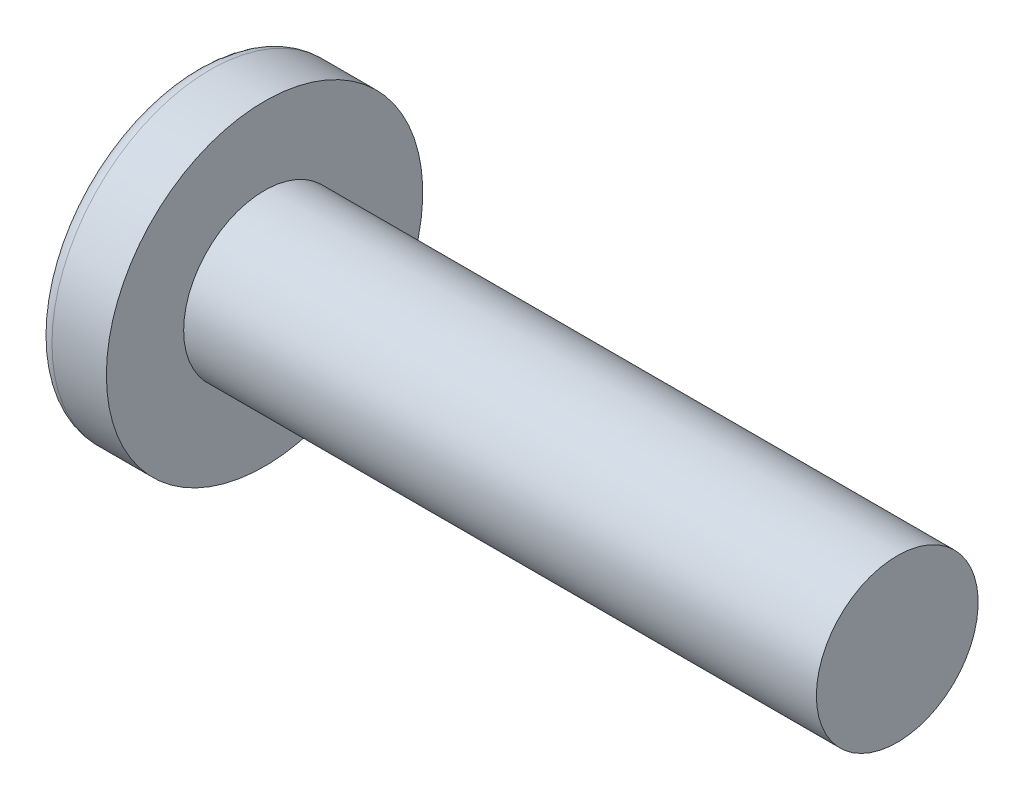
from build123d import *

# Parameters (mm, degrees)
CIRPATTERN1_COUNT = 2
CIRPATTERN1_ANGLE = 90


with BuildPart() as part:
    # BodySke → Base-Revolve (revolve)
    with BuildSketch(Plane.XY, mode=Mode.PRIVATE) as base_revolve_sk:
        with BuildLine():
            Line((2.032, 1.4224), (2.032, 2.7813))
            Line((2.032, 2.7813), (1.075646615, 2.7813))
            ThreePointArc((1.075646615, 2.7813), (0.960371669, 2.753635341), (0.87020729, 2.676667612))
            ThreePointArc((0.87020729, 2.676667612), (0.223015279, 1.407285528), (0, 0))
            Line((0, 0), (13.1572, 0))
            Line((13.1572, 0), (13.1572, 1.4224))
            Line((13.1572, 1.4224), (2.032, 1.4224))
        make_face()
    revolve(base_revolve_sk.sketch.rotate(Axis((-25.4, 0, 0), (1, 0, 0)), 90), axis=Axis((-25.4, 0, 0), (1, 0, 0)))

    # Sketch3 → Cut-Loft1 section 0
    with BuildSketch(Plane(origin=(0, 0, 0), x_dir=(0, 0, -1), z_dir=(1, 0, 0))):
        with BuildLine():
            Line((0.4064, -1.8161), (-0.4064, -1.8161))
            Line((-0.4064, -1.8161), (-0.4064, 1.8161))
            Line((-0.4064, 1.8161), (0.4064, 1.8161))
            Line((0.4064, 1.8161), (0.4064, -1.8161))
        make_face()
    # Sketch4 → Cut-Loft1 section 1
    with BuildSketch(Plane(origin=(2.0066, 0, 0), x_dir=(0, 0, -1), z_dir=(1, 0, 0))):
        with BuildLine():
            Line((0.2032, -0.2032), (-0.2032, -0.2032))
            Line((-0.2032, -0.2032), (-0.2032, 0.2032))
            Line((-0.2032, 0.2032), (0.2032, 0.2032))
            Line((0.2032, 0.2032), (0.2032, -0.2032))
        make_face()
    cut_loft1 = loft(mode=Mode.SUBTRACT)

    # CirPattern1: Cut-Loft1 ×2 about axis
    cirpattern1_axis = Axis((0, 0, 0), (1, 0, 0))
    for i in range(1, CIRPATTERN1_COUNT):
        add(cut_loft1.rotate(cirpattern1_axis, i * CIRPATTERN1_ANGLE / (CIRPATTERN1_COUNT - 1)), mode=Mode.SUBTRACT)


solid = part.part
